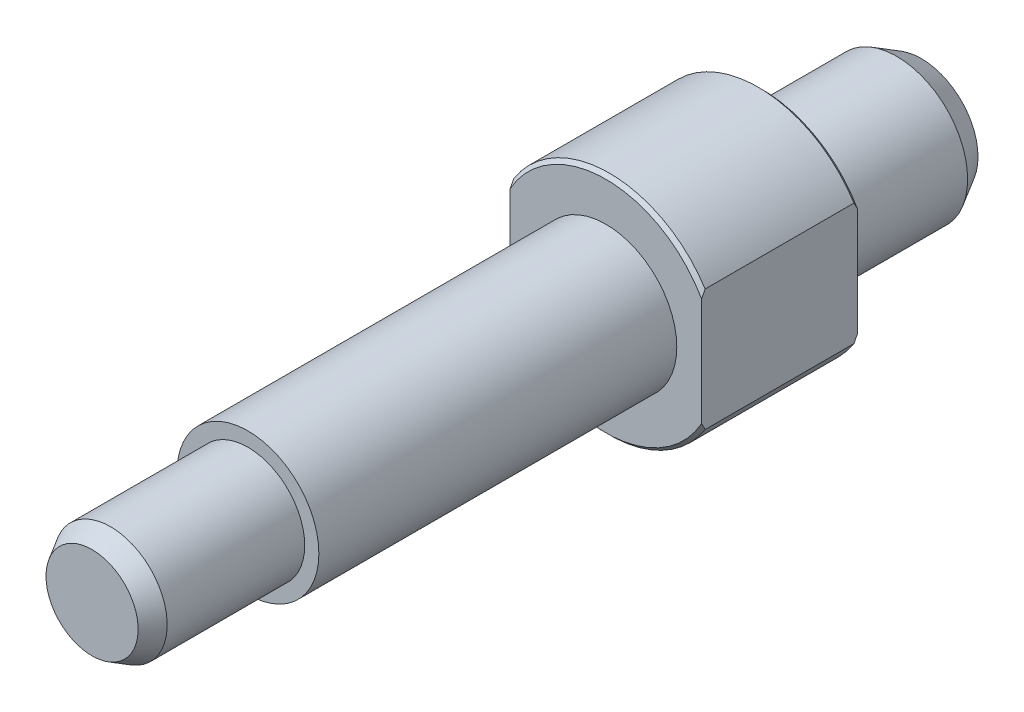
ISO-10303-21;
HEADER;
FILE_DESCRIPTION(('STEP AP214'),'2;1');
FILE_NAME('part.step','',(''),(''),'','','');
FILE_SCHEMA(('AUTOMOTIVE_DESIGN { 1 0 10303 214 1 1 1 1 }'));
ENDSEC;
DATA;
#1=APPLICATION_CONTEXT('core data for automotive mechanical design processes');
#2=APPLICATION_PROTOCOL_DEFINITION('international standard','automotive_design',2000,#1);
#3=PRODUCT_CONTEXT('',#1,'mechanical');
#4=PRODUCT('Part','Part','',(#3));
#5=PRODUCT_RELATED_PRODUCT_CATEGORY('part','',(#4));
#6=PRODUCT_DEFINITION_FORMATION('','',#4);
#7=PRODUCT_DEFINITION_CONTEXT('part definition',#1,'design');
#8=PRODUCT_DEFINITION('design','',#6,#7);
#9=PRODUCT_DEFINITION_SHAPE('','',#8);
#10=(LENGTH_UNIT() NAMED_UNIT(*) SI_UNIT(.MILLI.,.METRE.));
#11=(NAMED_UNIT(*) PLANE_ANGLE_UNIT() SI_UNIT($,.RADIAN.));
#12=(NAMED_UNIT(*) SI_UNIT($,.STERADIAN.) SOLID_ANGLE_UNIT());
#13=UNCERTAINTY_MEASURE_WITH_UNIT(LENGTH_MEASURE(1.E-05),#10,'distance_accuracy_value','');
#14=(GEOMETRIC_REPRESENTATION_CONTEXT(3) GLOBAL_UNCERTAINTY_ASSIGNED_CONTEXT((#13)) GLOBAL_UNIT_ASSIGNED_CONTEXT((#10,
#11,#12)) REPRESENTATION_CONTEXT('',''));
#15=CARTESIAN_POINT('',(0.,0.,0.));
#16=DIRECTION('',(0.,0.,1.));
#17=DIRECTION('',(1.,0.,0.));
#18=AXIS2_PLACEMENT_3D('',#15,#16,#17);
#19=CARTESIAN_POINT('',(0.,0.,0.));
#20=DIRECTION('',(0.,0.,1.));
#21=DIRECTION('',(1.,0.,0.));
#22=AXIS2_PLACEMENT_3D('',#19,#20,#21);
#23=PLANE('',#22);
#24=CARTESIAN_POINT('',(0.,0.,0.));
#25=DIRECTION('',(0.,0.,1.));
#26=DIRECTION('',(1.,0.,0.));
#27=AXIS2_PLACEMENT_3D('',#24,#25,#26);
#28=CIRCLE('',#27,10.);
#29=CARTESIAN_POINT('',(10.,0.,0.));
#30=VERTEX_POINT('',#29);
#31=EDGE_CURVE('E204',#30,#30,#28,.T.);
#32=ORIENTED_EDGE('',*,*,#31,.T.);
#33=EDGE_LOOP('',(#32));
#34=FACE_BOUND('',#33,.T.);
#35=DIRECTION('',(0.,1.,0.));
#36=VECTOR('',#35,1.);
#37=CARTESIAN_POINT('',(13.5,0.,0.));
#38=LINE('',#37,#36);
#39=CARTESIAN_POINT('',(13.5,-7.61577310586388,0.));
#40=VERTEX_POINT('',#39);
#41=CARTESIAN_POINT('',(13.5,7.61577310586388,0.));
#42=VERTEX_POINT('',#41);
#43=EDGE_CURVE('E211',#40,#42,#38,.T.);
#44=ORIENTED_EDGE('',*,*,#43,.F.);
#45=CARTESIAN_POINT('',(0.,0.,0.));
#46=DIRECTION('',(0.,0.,1.));
#47=DIRECTION('',(1.,0.,0.));
#48=AXIS2_PLACEMENT_3D('',#45,#46,#47);
#49=CIRCLE('',#48,15.5);
#50=CARTESIAN_POINT('',(-13.5,-7.61577310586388,0.));
#51=VERTEX_POINT('',#50);
#52=EDGE_CURVE('E401',#40,#51,#49,.F.);
#53=ORIENTED_EDGE('',*,*,#52,.T.);
#54=DIRECTION('',(0.,-1.,0.));
#55=VECTOR('',#54,1.);
#56=CARTESIAN_POINT('',(-13.5,0.,0.));
#57=LINE('',#56,#55);
#58=CARTESIAN_POINT('',(-13.5,7.61577310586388,0.));
#59=VERTEX_POINT('',#58);
#60=EDGE_CURVE('E87',#59,#51,#57,.T.);
#61=ORIENTED_EDGE('',*,*,#60,.F.);
#62=CARTESIAN_POINT('',(0.,0.,0.));
#63=DIRECTION('',(0.,0.,1.));
#64=DIRECTION('',(1.,0.,0.));
#65=AXIS2_PLACEMENT_3D('',#62,#63,#64);
#66=CIRCLE('',#65,15.5);
#67=EDGE_CURVE('E399',#59,#42,#66,.F.);
#68=ORIENTED_EDGE('',*,*,#67,.T.);
#69=EDGE_LOOP('',(#44,#53,#61,#68));
#70=FACE_BOUND('',#69,.T.);
#71=ADVANCED_FACE('F14',(#34,#70),#23,.F.);
#72=CARTESIAN_POINT('',(0.,0.,22.));
#73=DIRECTION('',(0.,0.,-1.));
#74=DIRECTION('',(-1.,0.,0.));
#75=AXIS2_PLACEMENT_3D('',#72,#73,#74);
#76=CYLINDRICAL_SURFACE('',#75,16.);
#77=DIRECTION('',(0.,0.,-1.));
#78=VECTOR('',#77,1.);
#79=CARTESIAN_POINT('',(13.5,8.58778201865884,22.));
#80=LINE('',#79,#78);
#81=CARTESIAN_POINT('',(13.5,8.58778201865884,0.5));
#82=VERTEX_POINT('',#81);
#83=CARTESIAN_POINT('',(13.5,8.58778201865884,21.5));
#84=VERTEX_POINT('',#83);
#85=EDGE_CURVE('E186',#82,#84,#80,.F.);
#86=ORIENTED_EDGE('',*,*,#85,.F.);
#87=CARTESIAN_POINT('',(0.,0.,0.5));
#88=DIRECTION('',(0.,0.,1.));
#89=DIRECTION('',(1.,0.,0.));
#90=AXIS2_PLACEMENT_3D('',#87,#88,#89);
#91=CIRCLE('',#90,16.);
#92=CARTESIAN_POINT('',(-13.5,8.58778201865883,0.5));
#93=VERTEX_POINT('',#92);
#94=EDGE_CURVE('E9',#82,#93,#91,.T.);
#95=ORIENTED_EDGE('',*,*,#94,.T.);
#96=DIRECTION('',(0.,0.,-1.));
#97=VECTOR('',#96,1.);
#98=CARTESIAN_POINT('',(-13.5,8.58778201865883,22.));
#99=LINE('',#98,#97);
#100=CARTESIAN_POINT('',(-13.5,8.58778201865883,21.5));
#101=VERTEX_POINT('',#100);
#102=EDGE_CURVE('E102',#101,#93,#99,.T.);
#103=ORIENTED_EDGE('',*,*,#102,.F.);
#104=CARTESIAN_POINT('',(0.,0.,21.5));
#105=DIRECTION('',(0.,0.,1.));
#106=DIRECTION('',(1.,0.,0.));
#107=AXIS2_PLACEMENT_3D('',#104,#105,#106);
#108=CIRCLE('',#107,16.);
#109=EDGE_CURVE('E23',#101,#84,#108,.F.);
#110=ORIENTED_EDGE('',*,*,#109,.T.);
#111=EDGE_LOOP('',(#86,#95,#103,#110));
#112=FACE_BOUND('',#111,.T.);
#113=ADVANCED_FACE('F185',(#112),#76,.T.);
#114=DIRECTION('',(0.,0.,-1.));
#115=VECTOR('',#114,1.);
#116=CARTESIAN_POINT('',(-13.5,-8.58778201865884,22.));
#117=LINE('',#116,#115);
#118=CARTESIAN_POINT('',(-13.5,-8.58778201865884,0.5));
#119=VERTEX_POINT('',#118);
#120=CARTESIAN_POINT('',(-13.5,-8.58778201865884,21.5));
#121=VERTEX_POINT('',#120);
#122=EDGE_CURVE('E84',#119,#121,#117,.F.);
#123=ORIENTED_EDGE('',*,*,#122,.F.);
#124=CARTESIAN_POINT('',(0.,0.,0.5));
#125=DIRECTION('',(0.,0.,1.));
#126=DIRECTION('',(1.,0.,0.));
#127=AXIS2_PLACEMENT_3D('',#124,#125,#126);
#128=CIRCLE('',#127,16.);
#129=CARTESIAN_POINT('',(13.5,-8.58778201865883,0.5));
#130=VERTEX_POINT('',#129);
#131=EDGE_CURVE('E98',#119,#130,#128,.T.);
#132=ORIENTED_EDGE('',*,*,#131,.T.);
#133=DIRECTION('',(0.,0.,-1.));
#134=VECTOR('',#133,1.);
#135=CARTESIAN_POINT('',(13.5,-8.58778201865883,22.));
#136=LINE('',#135,#134);
#137=CARTESIAN_POINT('',(13.5,-8.58778201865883,21.5));
#138=VERTEX_POINT('',#137);
#139=EDGE_CURVE('E193',#138,#130,#136,.T.);
#140=ORIENTED_EDGE('',*,*,#139,.F.);
#141=CARTESIAN_POINT('',(0.,0.,21.5));
#142=DIRECTION('',(0.,0.,1.));
#143=DIRECTION('',(1.,0.,0.));
#144=AXIS2_PLACEMENT_3D('',#141,#142,#143);
#145=CIRCLE('',#144,16.);
#146=EDGE_CURVE('E101',#138,#121,#145,.F.);
#147=ORIENTED_EDGE('',*,*,#146,.T.);
#148=EDGE_LOOP('',(#123,#132,#140,#147));
#149=FACE_BOUND('',#148,.T.);
#150=ADVANCED_FACE('F96',(#149),#76,.T.);
#151=CARTESIAN_POINT('',(0.,0.,22.));
#152=DIRECTION('',(0.,0.,1.));
#153=DIRECTION('',(1.,0.,0.));
#154=AXIS2_PLACEMENT_3D('',#151,#152,#153);
#155=PLANE('',#154);
#156=CARTESIAN_POINT('',(0.,0.,22.));
#157=DIRECTION('',(0.,0.,1.));
#158=DIRECTION('',(1.,0.,0.));
#159=AXIS2_PLACEMENT_3D('',#156,#157,#158);
#160=CIRCLE('',#159,10.);
#161=CARTESIAN_POINT('',(10.,0.,22.));
#162=VERTEX_POINT('',#161);
#163=EDGE_CURVE('E207',#162,#162,#160,.T.);
#164=ORIENTED_EDGE('',*,*,#163,.F.);
#165=EDGE_LOOP('',(#164));
#166=FACE_BOUND('',#165,.T.);
#167=DIRECTION('',(0.,-1.,0.));
#168=VECTOR('',#167,1.);
#169=CARTESIAN_POINT('',(-13.5,0.,22.));
#170=LINE('',#169,#168);
#171=CARTESIAN_POINT('',(-13.5,7.61577310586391,22.));
#172=VERTEX_POINT('',#171);
#173=CARTESIAN_POINT('',(-13.5,-7.61577310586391,22.));
#174=VERTEX_POINT('',#173);
#175=EDGE_CURVE('E111',#172,#174,#170,.T.);
#176=ORIENTED_EDGE('',*,*,#175,.T.);
#177=CARTESIAN_POINT('',(0.,0.,22.));
#178=DIRECTION('',(0.,0.,1.));
#179=DIRECTION('',(1.,0.,0.));
#180=AXIS2_PLACEMENT_3D('',#177,#178,#179);
#181=CIRCLE('',#180,15.5);
#182=CARTESIAN_POINT('',(13.5,-7.61577310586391,22.));
#183=VERTEX_POINT('',#182);
#184=EDGE_CURVE('E179',#174,#183,#181,.T.);
#185=ORIENTED_EDGE('',*,*,#184,.T.);
#186=DIRECTION('',(0.,1.,0.));
#187=VECTOR('',#186,1.);
#188=CARTESIAN_POINT('',(13.5,0.,22.));
#189=LINE('',#188,#187);
#190=CARTESIAN_POINT('',(13.5,7.61577310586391,22.));
#191=VERTEX_POINT('',#190);
#192=EDGE_CURVE('E200',#183,#191,#189,.T.);
#193=ORIENTED_EDGE('',*,*,#192,.T.);
#194=CARTESIAN_POINT('',(0.,0.,22.));
#195=DIRECTION('',(0.,0.,1.));
#196=DIRECTION('',(1.,0.,0.));
#197=AXIS2_PLACEMENT_3D('',#194,#195,#196);
#198=CIRCLE('',#197,15.5);
#199=EDGE_CURVE('E91',#191,#172,#198,.T.);
#200=ORIENTED_EDGE('',*,*,#199,.T.);
#201=EDGE_LOOP('',(#176,#185,#193,#200));
#202=FACE_BOUND('',#201,.T.);
#203=ADVANCED_FACE('F198',(#166,#202),#155,.T.);
#204=CARTESIAN_POINT('',(0.,0.,0.));
#205=DIRECTION('',(0.,0.,-1.));
#206=DIRECTION('',(-1.,0.,0.));
#207=AXIS2_PLACEMENT_3D('',#204,#205,#206);
#208=CYLINDRICAL_SURFACE('',#207,10.);
#209=CARTESIAN_POINT('',(0.,0.,-19.0358983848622));
#210=DIRECTION('',(0.,0.,1.));
#211=DIRECTION('',(1.,0.,0.));
#212=AXIS2_PLACEMENT_3D('',#209,#210,#211);
#213=CIRCLE('',#212,10.);
#214=CARTESIAN_POINT('',(10.,0.,-19.0358983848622));
#215=VERTEX_POINT('',#214);
#216=EDGE_CURVE('E103',#215,#215,#213,.T.);
#217=ORIENTED_EDGE('',*,*,#216,.T.);
#218=EDGE_LOOP('',(#217));
#219=FACE_BOUND('',#218,.T.);
#220=ORIENTED_EDGE('',*,*,#31,.F.);
#221=EDGE_LOOP('',(#220));
#222=FACE_BOUND('',#221,.T.);
#223=ADVANCED_FACE('F257',(#219,#222),#208,.T.);
#224=CARTESIAN_POINT('',(0.,0.,72.5));
#225=DIRECTION('',(0.,0.,-1.));
#226=DIRECTION('',(-1.,0.,0.));
#227=AXIS2_PLACEMENT_3D('',#224,#225,#226);
#228=CYLINDRICAL_SURFACE('',#227,10.);
#229=CARTESIAN_POINT('',(0.,0.,72.5));
#230=DIRECTION('',(0.,0.,1.));
#231=DIRECTION('',(1.,0.,0.));
#232=AXIS2_PLACEMENT_3D('',#229,#230,#231);
#233=CIRCLE('',#232,10.);
#234=CARTESIAN_POINT('',(10.,0.,72.5));
#235=VERTEX_POINT('',#234);
#236=EDGE_CURVE('E208',#235,#235,#233,.T.);
#237=ORIENTED_EDGE('',*,*,#236,.F.);
#238=EDGE_LOOP('',(#237));
#239=FACE_BOUND('',#238,.T.);
#240=ORIENTED_EDGE('',*,*,#163,.T.);
#241=EDGE_LOOP('',(#240));
#242=FACE_BOUND('',#241,.T.);
#243=ADVANCED_FACE('F254',(#239,#242),#228,.T.);
#244=CARTESIAN_POINT('',(0.,0.,72.5));
#245=DIRECTION('',(0.,0.,1.));
#246=DIRECTION('',(1.,0.,0.));
#247=AXIS2_PLACEMENT_3D('',#244,#245,#246);
#248=PLANE('',#247);
#249=CARTESIAN_POINT('',(0.,0.,72.5));
#250=DIRECTION('',(0.,0.,1.));
#251=DIRECTION('',(1.,0.,0.));
#252=AXIS2_PLACEMENT_3D('',#249,#250,#251);
#253=CIRCLE('',#252,8.);
#254=CARTESIAN_POINT('',(8.,0.,72.5));
#255=VERTEX_POINT('',#254);
#256=EDGE_CURVE('E201',#255,#255,#253,.T.);
#257=ORIENTED_EDGE('',*,*,#256,.F.);
#258=EDGE_LOOP('',(#257));
#259=FACE_BOUND('',#258,.T.);
#260=ORIENTED_EDGE('',*,*,#236,.T.);
#261=EDGE_LOOP('',(#260));
#262=FACE_BOUND('',#261,.T.);
#263=ADVANCED_FACE('F265',(#259,#262),#248,.T.);
#264=CARTESIAN_POINT('',(0.,0.,94.5));
#265=DIRECTION('',(0.,0.,-1.));
#266=DIRECTION('',(-1.,0.,0.));
#267=AXIS2_PLACEMENT_3D('',#264,#265,#266);
#268=CYLINDRICAL_SURFACE('',#267,8.);
#269=CARTESIAN_POINT('',(0.,0.,91.9019237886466));
#270=DIRECTION('',(0.,0.,-1.));
#271=DIRECTION('',(-1.,0.,0.));
#272=AXIS2_PLACEMENT_3D('',#269,#270,#271);
#273=CIRCLE('',#272,8.);
#274=CARTESIAN_POINT('',(-8.,0.,91.9019237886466));
#275=VERTEX_POINT('',#274);
#276=EDGE_CURVE('E225',#275,#275,#273,.T.);
#277=ORIENTED_EDGE('',*,*,#276,.T.);
#278=EDGE_LOOP('',(#277));
#279=FACE_BOUND('',#278,.T.);
#280=ORIENTED_EDGE('',*,*,#256,.T.);
#281=EDGE_LOOP('',(#280));
#282=FACE_BOUND('',#281,.T.);
#283=ADVANCED_FACE('F130',(#279,#282),#268,.T.);
#284=CARTESIAN_POINT('',(13.5,17.6910569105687,94.5));
#285=DIRECTION('',(1.,0.,0.));
#286=DIRECTION('',(0.,1.,0.));
#287=AXIS2_PLACEMENT_3D('',#284,#285,#286);
#288=PLANE('',#287);
#289=ORIENTED_EDGE('',*,*,#139,.T.);
#290=CARTESIAN_POINT('',(13.5,-8.58778201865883,0.5));
#291=CARTESIAN_POINT('',(13.5,-8.50751562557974,0.456918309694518));
#292=CARTESIAN_POINT('',(13.5,-8.42706999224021,0.414170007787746));
#293=CARTESIAN_POINT('',(13.5,-8.26581899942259,0.329373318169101));
#294=CARTESIAN_POINT('',(13.5,-8.18501366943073,0.287324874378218));
#295=CARTESIAN_POINT('',(13.5,-8.0230287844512,0.203953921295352));
#296=CARTESIAN_POINT('',(13.5,-7.94184922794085,0.162631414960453));
#297=CARTESIAN_POINT('',(13.5,-7.77910228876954,0.0807409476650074));
#298=CARTESIAN_POINT('',(13.5,-7.69753487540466,0.0401730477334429));
#299=CARTESIAN_POINT('',(13.5,-7.61577310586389,0.));
#300=B_SPLINE_CURVE_WITH_KNOTS('',3,(#290,#291,#292,#293,#294,#295,#296,#297,#298,#299),
.UNSPECIFIED.,.F.,.F.,(4,2,2,2,4),(0.,0.273291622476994,0.546561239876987,0.819831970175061,
1.09312470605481),.UNSPECIFIED.);
#301=EDGE_CURVE('E106',#130,#40,#300,.T.);
#302=ORIENTED_EDGE('',*,*,#301,.T.);
#303=ORIENTED_EDGE('',*,*,#43,.T.);
#304=CARTESIAN_POINT('',(13.5,7.61577310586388,0.));
#305=CARTESIAN_POINT('',(13.5,7.69753487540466,0.0401730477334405));
#306=CARTESIAN_POINT('',(13.5,7.77910228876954,0.0807409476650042));
#307=CARTESIAN_POINT('',(13.5,7.94184922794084,0.162631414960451));
#308=CARTESIAN_POINT('',(13.5,8.0230287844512,0.20395392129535));
#309=CARTESIAN_POINT('',(13.5,8.18501366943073,0.287324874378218));
#310=CARTESIAN_POINT('',(13.5,8.26581899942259,0.329373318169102));
#311=CARTESIAN_POINT('',(13.5,8.42706999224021,0.414170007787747));
#312=CARTESIAN_POINT('',(13.5,8.50751562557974,0.456918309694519));
#313=CARTESIAN_POINT('',(13.5,8.58778201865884,0.5));
#314=B_SPLINE_CURVE_WITH_KNOTS('',3,(#304,#305,#306,#307,#308,#309,#310,#311,#312,#313),
.UNSPECIFIED.,.F.,.F.,(4,2,2,2,4),(0.,0.273292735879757,0.546563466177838,0.819833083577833,
1.09312470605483),.UNSPECIFIED.);
#315=EDGE_CURVE('E109',#42,#82,#314,.T.);
#316=ORIENTED_EDGE('',*,*,#315,.T.);
#317=ORIENTED_EDGE('',*,*,#85,.T.);
#318=CARTESIAN_POINT('',(13.5,8.58778201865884,21.5));
#319=CARTESIAN_POINT('',(13.5,8.50751562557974,21.5430816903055));
#320=CARTESIAN_POINT('',(13.5,8.42706999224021,21.5858299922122));
#321=CARTESIAN_POINT('',(13.5,8.2658189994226,21.6706266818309));
#322=CARTESIAN_POINT('',(13.5,8.18501366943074,21.7126751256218));
#323=CARTESIAN_POINT('',(13.5,8.02302878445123,21.7960460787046));
#324=CARTESIAN_POINT('',(13.5,7.94184922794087,21.8373685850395));
#325=CARTESIAN_POINT('',(13.5,7.77910228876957,21.919259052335));
#326=CARTESIAN_POINT('',(13.5,7.69753487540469,21.9598269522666));
#327=CARTESIAN_POINT('',(13.5,7.61577310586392,22.));
#328=B_SPLINE_CURVE_WITH_KNOTS('',3,(#318,#319,#320,#321,#322,#323,#324,#325,#326,#327),
.UNSPECIFIED.,.F.,.F.,(4,2,2,2,4),(0.,0.273291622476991,0.546561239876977,0.819831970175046,
1.0931247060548),.UNSPECIFIED.);
#329=EDGE_CURVE('E107',#84,#191,#328,.T.);
#330=ORIENTED_EDGE('',*,*,#329,.T.);
#331=ORIENTED_EDGE('',*,*,#192,.F.);
#332=CARTESIAN_POINT('',(13.5,-7.61577310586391,22.));
#333=CARTESIAN_POINT('',(13.5,-7.69753487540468,21.9598269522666));
#334=CARTESIAN_POINT('',(13.5,-7.77910228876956,21.919259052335));
#335=CARTESIAN_POINT('',(13.5,-7.94184922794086,21.8373685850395));
#336=CARTESIAN_POINT('',(13.5,-8.02302878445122,21.7960460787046));
#337=CARTESIAN_POINT('',(13.5,-8.18501366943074,21.7126751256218));
#338=CARTESIAN_POINT('',(13.5,-8.2658189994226,21.6706266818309));
#339=CARTESIAN_POINT('',(13.5,-8.42706999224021,21.5858299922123));
#340=CARTESIAN_POINT('',(13.5,-8.50751562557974,21.5430816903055));
#341=CARTESIAN_POINT('',(13.5,-8.58778201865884,21.5));
#342=B_SPLINE_CURVE_WITH_KNOTS('',3,(#332,#333,#334,#335,#336,#337,#338,#339,#340,#341),
.UNSPECIFIED.,.F.,.F.,(4,2,2,2,4),(0.,0.27329273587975,0.546563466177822,0.819833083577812,
1.0931247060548),.UNSPECIFIED.);
#343=EDGE_CURVE('E140',#183,#138,#342,.T.);
#344=ORIENTED_EDGE('',*,*,#343,.T.);
#345=EDGE_LOOP('',(#289,#302,#303,#316,#317,#330,#331,#344));
#346=FACE_BOUND('',#345,.T.);
#347=ADVANCED_FACE('F125',(#346),#288,.T.);
#348=CARTESIAN_POINT('',(-13.5,17.6910569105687,94.5));
#349=DIRECTION('',(-1.,0.,0.));
#350=DIRECTION('',(0.,-1.,0.));
#351=AXIS2_PLACEMENT_3D('',#348,#349,#350);
#352=PLANE('',#351);
#353=ORIENTED_EDGE('',*,*,#60,.T.);
#354=CARTESIAN_POINT('',(-13.5,-7.61577310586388,0.));
#355=CARTESIAN_POINT('',(-13.5,-7.69753487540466,0.0401730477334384));
#356=CARTESIAN_POINT('',(-13.5,-7.77910228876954,0.0807409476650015));
#357=CARTESIAN_POINT('',(-13.5,-7.94184922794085,0.162631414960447));
#358=CARTESIAN_POINT('',(-13.5,-8.0230287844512,0.203953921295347));
#359=CARTESIAN_POINT('',(-13.5,-8.18501366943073,0.287324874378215));
#360=CARTESIAN_POINT('',(-13.5,-8.2658189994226,0.329373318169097));
#361=CARTESIAN_POINT('',(-13.5,-8.42706999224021,0.414170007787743));
#362=CARTESIAN_POINT('',(-13.5,-8.50751562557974,0.456918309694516));
#363=CARTESIAN_POINT('',(-13.5,-8.58778201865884,0.5));
#364=B_SPLINE_CURVE_WITH_KNOTS('',3,(#354,#355,#356,#357,#358,#359,#360,#361,#362,#363),
.UNSPECIFIED.,.F.,.F.,(4,2,2,2,4),(0.,0.273292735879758,0.546563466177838,0.819833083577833,
1.09312470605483),.UNSPECIFIED.);
#365=EDGE_CURVE('E81',#51,#119,#364,.T.);
#366=ORIENTED_EDGE('',*,*,#365,.T.);
#367=ORIENTED_EDGE('',*,*,#122,.T.);
#368=CARTESIAN_POINT('',(-13.5,-8.58778201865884,21.5));
#369=CARTESIAN_POINT('',(-13.5,-8.50751562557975,21.5430816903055));
#370=CARTESIAN_POINT('',(-13.5,-8.42706999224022,21.5858299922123));
#371=CARTESIAN_POINT('',(-13.5,-8.26581899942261,21.6706266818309));
#372=CARTESIAN_POINT('',(-13.5,-8.18501366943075,21.7126751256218));
#373=CARTESIAN_POINT('',(-13.5,-8.02302878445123,21.7960460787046));
#374=CARTESIAN_POINT('',(-13.5,-7.94184922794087,21.8373685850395));
#375=CARTESIAN_POINT('',(-13.5,-7.77910228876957,21.919259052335));
#376=CARTESIAN_POINT('',(-13.5,-7.69753487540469,21.9598269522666));
#377=CARTESIAN_POINT('',(-13.5,-7.61577310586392,22.));
#378=B_SPLINE_CURVE_WITH_KNOTS('',3,(#368,#369,#370,#371,#372,#373,#374,#375,#376,#377),
.UNSPECIFIED.,.F.,.F.,(4,2,2,2,4),(0.,0.273291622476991,0.546561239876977,0.819831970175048,
1.0931247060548),.UNSPECIFIED.);
#379=EDGE_CURVE('E92',#121,#174,#378,.T.);
#380=ORIENTED_EDGE('',*,*,#379,.T.);
#381=ORIENTED_EDGE('',*,*,#175,.F.);
#382=CARTESIAN_POINT('',(-13.5,7.61577310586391,22.));
#383=CARTESIAN_POINT('',(-13.5,7.69753487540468,21.9598269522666));
#384=CARTESIAN_POINT('',(-13.5,7.77910228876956,21.919259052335));
#385=CARTESIAN_POINT('',(-13.5,7.94184922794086,21.8373685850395));
#386=CARTESIAN_POINT('',(-13.5,8.02302878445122,21.7960460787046));
#387=CARTESIAN_POINT('',(-13.5,8.18501366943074,21.7126751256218));
#388=CARTESIAN_POINT('',(-13.5,8.2658189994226,21.6706266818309));
#389=CARTESIAN_POINT('',(-13.5,8.42706999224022,21.5858299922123));
#390=CARTESIAN_POINT('',(-13.5,8.50751562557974,21.5430816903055));
#391=CARTESIAN_POINT('',(-13.5,8.58778201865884,21.5));
#392=B_SPLINE_CURVE_WITH_KNOTS('',3,(#382,#383,#384,#385,#386,#387,#388,#389,#390,#391),
.UNSPECIFIED.,.F.,.F.,(4,2,2,2,4),(0.,0.273292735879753,0.546563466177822,0.819833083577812,
1.0931247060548),.UNSPECIFIED.);
#393=EDGE_CURVE('E37',#172,#101,#392,.T.);
#394=ORIENTED_EDGE('',*,*,#393,.T.);
#395=ORIENTED_EDGE('',*,*,#102,.T.);
#396=CARTESIAN_POINT('',(-13.5,8.58778201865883,0.5));
#397=CARTESIAN_POINT('',(-13.5,8.50751562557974,0.456918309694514));
#398=CARTESIAN_POINT('',(-13.5,8.42706999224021,0.414170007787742));
#399=CARTESIAN_POINT('',(-13.5,8.26581899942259,0.329373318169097));
#400=CARTESIAN_POINT('',(-13.5,8.18501366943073,0.287324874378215));
#401=CARTESIAN_POINT('',(-13.5,8.02302878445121,0.203953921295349));
#402=CARTESIAN_POINT('',(-13.5,7.94184922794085,0.16263141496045));
#403=CARTESIAN_POINT('',(-13.5,7.77910228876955,0.0807409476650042));
#404=CARTESIAN_POINT('',(-13.5,7.69753487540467,0.0401730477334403));
#405=CARTESIAN_POINT('',(-13.5,7.61577310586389,0.));
#406=B_SPLINE_CURVE_WITH_KNOTS('',3,(#396,#397,#398,#399,#400,#401,#402,#403,#404,#405),
.UNSPECIFIED.,.F.,.F.,(4,2,2,2,4),(0.,0.273291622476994,0.546561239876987,0.81983197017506,
1.09312470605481),.UNSPECIFIED.);
#407=EDGE_CURVE('E30',#93,#59,#406,.T.);
#408=ORIENTED_EDGE('',*,*,#407,.T.);
#409=EDGE_LOOP('',(#353,#366,#367,#380,#381,#394,#395,#408));
#410=FACE_BOUND('',#409,.T.);
#411=ADVANCED_FACE('F83',(#410),#352,.T.);
#412=CARTESIAN_POINT('',(0.,0.,0.5));
#413=DIRECTION('',(0.,0.,1.));
#414=DIRECTION('',(1.,0.,0.));
#415=AXIS2_PLACEMENT_3D('',#412,#413,#414);
#416=CONICAL_SURFACE('',#415,16.,0.785398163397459);
#417=ORIENTED_EDGE('',*,*,#365,.F.);
#418=ORIENTED_EDGE('',*,*,#52,.F.);
#419=ORIENTED_EDGE('',*,*,#301,.F.);
#420=ORIENTED_EDGE('',*,*,#131,.F.);
#421=EDGE_LOOP('',(#417,#418,#419,#420));
#422=FACE_BOUND('',#421,.T.);
#423=ADVANCED_FACE('F105',(#422),#416,.T.);
#424=CARTESIAN_POINT('',(0.,0.,22.));
#425=DIRECTION('',(0.,0.,-1.));
#426=DIRECTION('',(-1.,0.,0.));
#427=AXIS2_PLACEMENT_3D('',#424,#425,#426);
#428=CONICAL_SURFACE('',#427,15.5,0.785398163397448);
#429=ORIENTED_EDGE('',*,*,#379,.F.);
#430=ORIENTED_EDGE('',*,*,#146,.F.);
#431=ORIENTED_EDGE('',*,*,#343,.F.);
#432=ORIENTED_EDGE('',*,*,#184,.F.);
#433=EDGE_LOOP('',(#429,#430,#431,#432));
#434=FACE_BOUND('',#433,.T.);
#435=ADVANCED_FACE('F152',(#434),#428,.T.);
#436=CARTESIAN_POINT('',(0.,0.,0.5));
#437=DIRECTION('',(0.,0.,1.));
#438=DIRECTION('',(1.,0.,0.));
#439=AXIS2_PLACEMENT_3D('',#436,#437,#438);
#440=CONICAL_SURFACE('',#439,16.,0.785398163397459);
#441=ORIENTED_EDGE('',*,*,#315,.F.);
#442=ORIENTED_EDGE('',*,*,#67,.F.);
#443=ORIENTED_EDGE('',*,*,#407,.F.);
#444=ORIENTED_EDGE('',*,*,#94,.F.);
#445=EDGE_LOOP('',(#441,#442,#443,#444));
#446=FACE_BOUND('',#445,.T.);
#447=ADVANCED_FACE('F155',(#446),#440,.T.);
#448=CARTESIAN_POINT('',(0.,0.,22.));
#449=DIRECTION('',(0.,0.,-1.));
#450=DIRECTION('',(-1.,0.,0.));
#451=AXIS2_PLACEMENT_3D('',#448,#449,#450);
#452=CONICAL_SURFACE('',#451,15.5,0.785398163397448);
#453=ORIENTED_EDGE('',*,*,#329,.F.);
#454=ORIENTED_EDGE('',*,*,#109,.F.);
#455=ORIENTED_EDGE('',*,*,#393,.F.);
#456=ORIENTED_EDGE('',*,*,#199,.F.);
#457=EDGE_LOOP('',(#453,#454,#455,#456));
#458=FACE_BOUND('',#457,.T.);
#459=ADVANCED_FACE('F16',(#458),#452,.T.);
#460=CARTESIAN_POINT('',(0.,0.,-11.2004431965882));
#461=DIRECTION('',(0.,0.,1.));
#462=DIRECTION('',(1.,0.,0.));
#463=AXIS2_PLACEMENT_3D('',#460,#461,#462);
#464=CONICAL_SURFACE('',#463,14.5238021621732,0.523598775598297);
#465=CARTESIAN_POINT('',(0.,0.,-22.5));
#466=DIRECTION('',(0.,0.,-1.));
#467=DIRECTION('',(-1.,0.,0.));
#468=AXIS2_PLACEMENT_3D('',#465,#466,#467);
#469=CIRCLE('',#468,8.);
#470=CARTESIAN_POINT('',(-8.,0.,-22.5));
#471=VERTEX_POINT('',#470);
#472=EDGE_CURVE('E222',#471,#471,#469,.T.);
#473=ORIENTED_EDGE('',*,*,#472,.F.);
#474=EDGE_LOOP('',(#473));
#475=FACE_BOUND('',#474,.T.);
#476=ORIENTED_EDGE('',*,*,#216,.F.);
#477=EDGE_LOOP('',(#476));
#478=FACE_BOUND('',#477,.T.);
#479=ADVANCED_FACE('F261',(#475,#478),#464,.T.);
#480=CARTESIAN_POINT('',(0.,0.,-22.5));
#481=DIRECTION('',(0.,0.,1.));
#482=DIRECTION('',(1.,0.,0.));
#483=AXIS2_PLACEMENT_3D('',#480,#481,#482);
#484=PLANE('',#483);
#485=ORIENTED_EDGE('',*,*,#472,.T.);
#486=EDGE_LOOP('',(#485));
#487=FACE_BOUND('',#486,.T.);
#488=ADVANCED_FACE('F241',(#487),#484,.F.);
#489=CARTESIAN_POINT('',(0.,0.,94.5));
#490=DIRECTION('',(0.,0.,-1.));
#491=DIRECTION('',(-1.,0.,0.));
#492=AXIS2_PLACEMENT_3D('',#489,#490,#491);
#493=CONICAL_SURFACE('',#492,6.5,0.523598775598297);
#494=CARTESIAN_POINT('',(0.,0.,94.5));
#495=DIRECTION('',(0.,0.,-1.));
#496=DIRECTION('',(-1.,0.,0.));
#497=AXIS2_PLACEMENT_3D('',#494,#495,#496);
#498=CIRCLE('',#497,6.5);
#499=CARTESIAN_POINT('',(-6.5,0.,94.5));
#500=VERTEX_POINT('',#499);
#501=EDGE_CURVE('E228',#500,#500,#498,.T.);
#502=ORIENTED_EDGE('',*,*,#501,.T.);
#503=EDGE_LOOP('',(#502));
#504=FACE_BOUND('',#503,.T.);
#505=ORIENTED_EDGE('',*,*,#276,.F.);
#506=EDGE_LOOP('',(#505));
#507=FACE_BOUND('',#506,.T.);
#508=ADVANCED_FACE('F232',(#504,#507),#493,.T.);
#509=CARTESIAN_POINT('',(0.,0.,94.5));
#510=DIRECTION('',(0.,0.,1.));
#511=DIRECTION('',(1.,0.,0.));
#512=AXIS2_PLACEMENT_3D('',#509,#510,#511);
#513=PLANE('',#512);
#514=ORIENTED_EDGE('',*,*,#501,.F.);
#515=EDGE_LOOP('',(#514));
#516=FACE_BOUND('',#515,.T.);
#517=ADVANCED_FACE('F134',(#516),#513,.T.);
#518=CLOSED_SHELL('',(#71,#113,#150,#203,#223,#243,#263,#283,#347,#411,#423,#435,#447,#459,#479,
#488,#508,#517));
#519=MANIFOLD_SOLID_BREP('B1',#518);
#520=ADVANCED_BREP_SHAPE_REPRESENTATION('',(#18,#519),#14);
#521=SHAPE_DEFINITION_REPRESENTATION(#9,#520);
ENDSEC;
END-ISO-10303-21;
